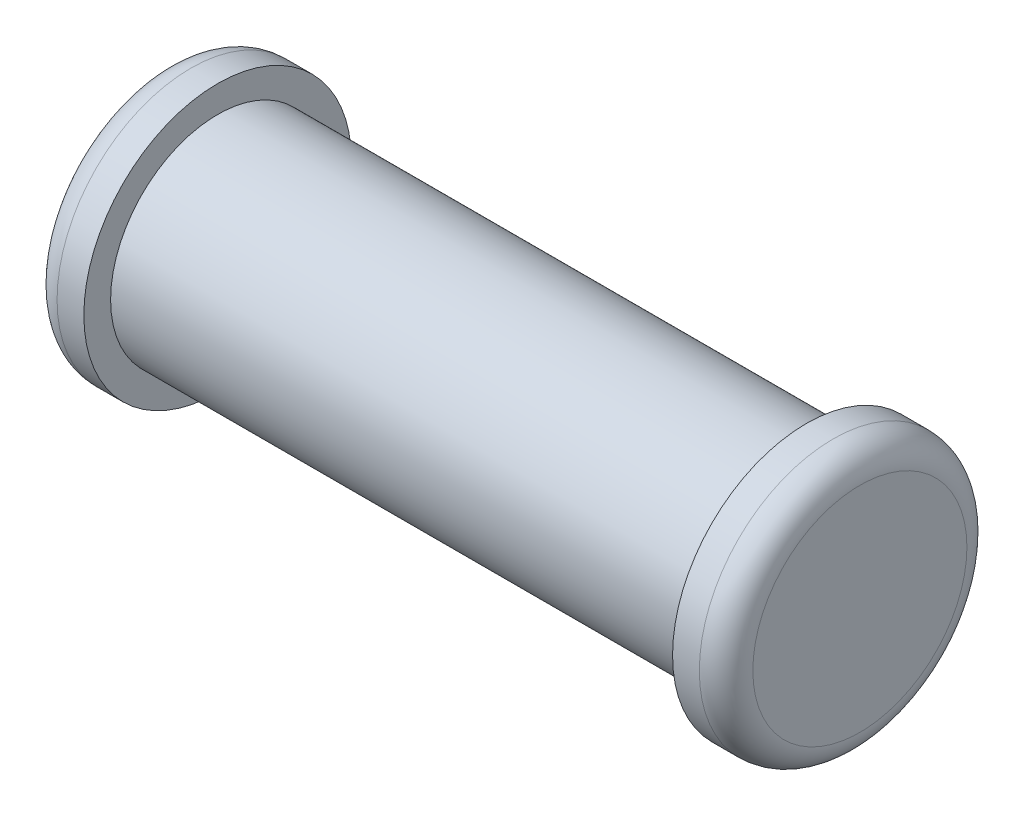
from build123d import *

# Parameters (mm, degrees)
SKETCH1_R            = 2
BOSS_EXTRUDE1_DEPTH  = 11
SKETCH2_R            = 2.5
BOSS_EXTRUDE2_DEPTH  = 1
FILLET1_R            = 0.5
FILLET1_OF_MIRROR1_R = 0.5


with BuildPart() as part:
    # Sketch1 → Boss-Extrude1 (new body)
    with BuildSketch(Plane(origin=(0, 0, 0), x_dir=(0, 0, -1), z_dir=(1, 0, 0))):
        Circle(SKETCH1_R)
    extrude(amount=BOSS_EXTRUDE1_DEPTH)

    # Sketch2 → Boss-Extrude2 (add)
    with BuildSketch(Plane.ZY):
        Circle(SKETCH2_R)
    boss_extrude2 = extrude(amount=BOSS_EXTRUDE2_DEPTH)

    # Fillet1
    fillet1_edges = [part.edges().sort_by_distance(p)[0] for p in [
        (-1, 0, -2.5),
    ]]
    fillet(fillet1_edges, radius=FILLET1_R)

    # Mirror1: Boss-Extrude2 across plane
    add(boss_extrude2.mirror(Plane(origin=(5.5, 0, 0), x_dir=(0, 0, 1), z_dir=(1, 0, 0))))

    # Fillet1 of Mirror1
    fillet1_of_mirror1_edges = [part.edges().sort_by_distance(p)[0] for p in [
        (12, 0, -2.5),
    ]]
    fillet(fillet1_of_mirror1_edges, radius=FILLET1_OF_MIRROR1_R)


solid = part.part
